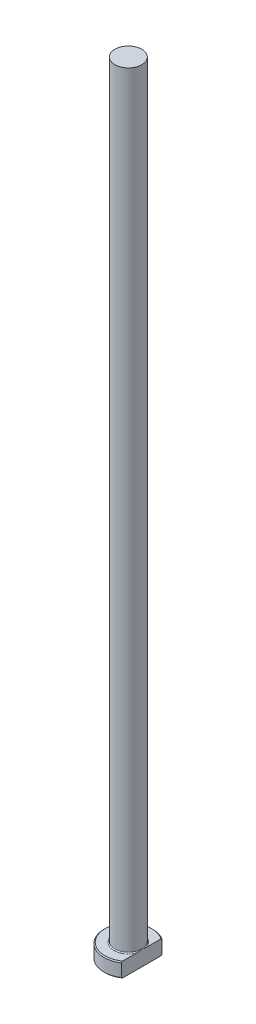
from build123d import *
from build123d.topology import SkipClean

# Parameters (mm, degrees)
CHAMFER1_SIZE = 0.2
FILLET1_R     = 0.2
KEY_DEPTH     = 161.15617378


with BuildPart() as part:
    # Sketch1 → Revolve1 (revolve)
    with BuildSketch(Plane.XY, mode=Mode.PRIVATE) as revolve1_sk:
        Polygon((0, 0), (-5, 0), (-5, 3), (-2.75, 3), (-2.75, 160), (0, 160), align=None)
    revolve(revolve1_sk.sketch.rotate(Axis((0, 259.958771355, 0), (0, -1, 0)), 270), axis=Axis((0, 259.958771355, 0), (0, -1, 0)))

    # Chamfer1
    chamfer1_edges = [part.edges().sort_by_distance(p)[0] for p in [
        (0, 3, -5),
        (0, 0, -5),
    ]]
    chamfer(chamfer1_edges, length=CHAMFER1_SIZE)

    # Fillet1
    fillet1_edges = [part.edges().sort_by_distance(p)[0] for p in [
        (0, 3, -2.75),
    ]]
    fillet(fillet1_edges, radius=FILLET1_R)

    # Sketch2 → KEY (cut, through all)
    with SkipClean():  # the faces are left unmerged after this step: merging them gives an invalid solid
        with BuildSketch(Plane(origin=(0, 0, 0), x_dir=(1, 0, 0), z_dir=(0, 1, 0))):
            with BuildLine():
                Line((2.75, 4.175823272), (2.75, -4.175823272))
                ThreePointArc((2.75, -4.175823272), (5, 0), (2.75, 4.175823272))
            make_face()
        extrude(amount=KEY_DEPTH, mode=Mode.SUBTRACT)


solid = part.part
